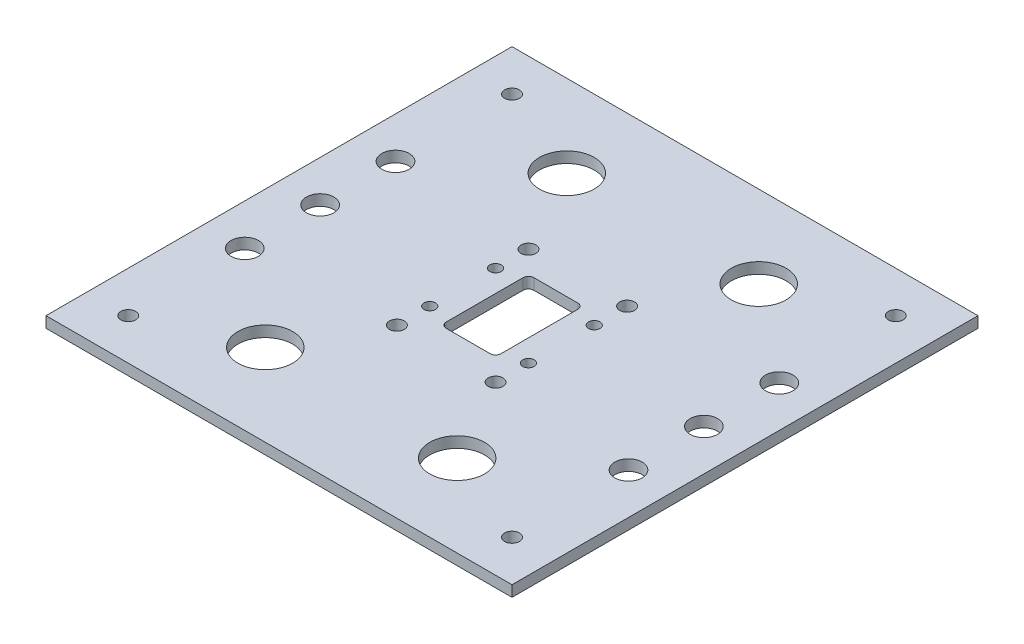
ISO-10303-21;
HEADER;
FILE_DESCRIPTION(('STEP AP214'),'2;1');
FILE_NAME('part.step','',(''),(''),'','','');
FILE_SCHEMA(('AUTOMOTIVE_DESIGN { 1 0 10303 214 1 1 1 1 }'));
ENDSEC;
DATA;
#1=APPLICATION_CONTEXT('core data for automotive mechanical design processes');
#2=APPLICATION_PROTOCOL_DEFINITION('international standard','automotive_design',2000,#1);
#3=PRODUCT_CONTEXT('',#1,'mechanical');
#4=PRODUCT('Part','Part','',(#3));
#5=PRODUCT_RELATED_PRODUCT_CATEGORY('part','',(#4));
#6=PRODUCT_DEFINITION_FORMATION('','',#4);
#7=PRODUCT_DEFINITION_CONTEXT('part definition',#1,'design');
#8=PRODUCT_DEFINITION('design','',#6,#7);
#9=PRODUCT_DEFINITION_SHAPE('','',#8);
#10=(LENGTH_UNIT() NAMED_UNIT(*) SI_UNIT(.MILLI.,.METRE.));
#11=(NAMED_UNIT(*) PLANE_ANGLE_UNIT() SI_UNIT($,.RADIAN.));
#12=(NAMED_UNIT(*) SI_UNIT($,.STERADIAN.) SOLID_ANGLE_UNIT());
#13=UNCERTAINTY_MEASURE_WITH_UNIT(LENGTH_MEASURE(1.E-05),#10,'distance_accuracy_value','');
#14=(GEOMETRIC_REPRESENTATION_CONTEXT(3) GLOBAL_UNCERTAINTY_ASSIGNED_CONTEXT((#13)) GLOBAL_UNIT_ASSIGNED_CONTEXT((#10,
#11,#12)) REPRESENTATION_CONTEXT('',''));
#15=CARTESIAN_POINT('',(0.,0.,0.));
#16=DIRECTION('',(0.,0.,1.));
#17=DIRECTION('',(1.,0.,0.));
#18=AXIS2_PLACEMENT_3D('',#15,#16,#17);
#19=CARTESIAN_POINT('',(-8.,-6.,14.));
#20=DIRECTION('',(0.,-1.,0.));
#21=DIRECTION('',(0.,0.,-1.));
#22=AXIS2_PLACEMENT_3D('',#19,#20,#21);
#23=CYLINDRICAL_SURFACE('',#22,2.);
#24=CARTESIAN_POINT('',(-8.,0.,14.));
#25=DIRECTION('',(0.,1.,0.));
#26=DIRECTION('',(0.,0.,-1.));
#27=AXIS2_PLACEMENT_3D('',#24,#25,#26);
#28=CIRCLE('',#27,2.);
#29=CARTESIAN_POINT('',(-10.,0.,14.));
#30=VERTEX_POINT('',#29);
#31=CARTESIAN_POINT('',(-8.,0.,16.));
#32=VERTEX_POINT('',#31);
#33=EDGE_CURVE('E246',#30,#32,#28,.T.);
#34=ORIENTED_EDGE('',*,*,#33,.F.);
#35=DIRECTION('',(0.,-1.,0.));
#36=VECTOR('',#35,1.);
#37=CARTESIAN_POINT('',(-10.,0.,14.));
#38=LINE('',#37,#36);
#39=CARTESIAN_POINT('',(-10.,4.,14.));
#40=VERTEX_POINT('',#39);
#41=EDGE_CURVE('E412',#40,#30,#38,.T.);
#42=ORIENTED_EDGE('',*,*,#41,.F.);
#43=CARTESIAN_POINT('',(-8.,4.,14.));
#44=DIRECTION('',(0.,-1.,0.));
#45=DIRECTION('',(0.,0.,-1.));
#46=AXIS2_PLACEMENT_3D('',#43,#44,#45);
#47=CIRCLE('',#46,2.);
#48=CARTESIAN_POINT('',(-8.,4.,16.));
#49=VERTEX_POINT('',#48);
#50=EDGE_CURVE('E221',#49,#40,#47,.T.);
#51=ORIENTED_EDGE('',*,*,#50,.F.);
#52=DIRECTION('',(0.,1.,0.));
#53=VECTOR('',#52,1.);
#54=CARTESIAN_POINT('',(-8.,4.,16.));
#55=LINE('',#54,#53);
#56=EDGE_CURVE('E49',#32,#49,#55,.T.);
#57=ORIENTED_EDGE('',*,*,#56,.F.);
#58=EDGE_LOOP('',(#34,#42,#51,#57));
#59=FACE_BOUND('',#58,.T.);
#60=ADVANCED_FACE('F17',(#59),#23,.F.);
#61=CARTESIAN_POINT('',(8.,-6.,14.));
#62=DIRECTION('',(0.,-1.,0.));
#63=DIRECTION('',(0.,0.,-1.));
#64=AXIS2_PLACEMENT_3D('',#61,#62,#63);
#65=CYLINDRICAL_SURFACE('',#64,2.);
#66=CARTESIAN_POINT('',(8.,0.,14.));
#67=DIRECTION('',(0.,1.,0.));
#68=DIRECTION('',(0.,0.,-1.));
#69=AXIS2_PLACEMENT_3D('',#66,#67,#68);
#70=CIRCLE('',#69,2.);
#71=CARTESIAN_POINT('',(8.,0.,16.));
#72=VERTEX_POINT('',#71);
#73=CARTESIAN_POINT('',(10.,0.,14.));
#74=VERTEX_POINT('',#73);
#75=EDGE_CURVE('E152',#72,#74,#70,.T.);
#76=ORIENTED_EDGE('',*,*,#75,.F.);
#77=DIRECTION('',(0.,-1.,0.));
#78=VECTOR('',#77,1.);
#79=CARTESIAN_POINT('',(8.,0.,16.));
#80=LINE('',#79,#78);
#81=CARTESIAN_POINT('',(8.,4.,16.));
#82=VERTEX_POINT('',#81);
#83=EDGE_CURVE('E38',#82,#72,#80,.T.);
#84=ORIENTED_EDGE('',*,*,#83,.F.);
#85=CARTESIAN_POINT('',(8.,4.,14.));
#86=DIRECTION('',(0.,-1.,0.));
#87=DIRECTION('',(0.,0.,-1.));
#88=AXIS2_PLACEMENT_3D('',#85,#86,#87);
#89=CIRCLE('',#88,2.);
#90=CARTESIAN_POINT('',(10.,4.,14.));
#91=VERTEX_POINT('',#90);
#92=EDGE_CURVE('E346',#91,#82,#89,.T.);
#93=ORIENTED_EDGE('',*,*,#92,.F.);
#94=DIRECTION('',(0.,1.,0.));
#95=VECTOR('',#94,1.);
#96=CARTESIAN_POINT('',(10.,4.,14.));
#97=LINE('',#96,#95);
#98=EDGE_CURVE('E197',#74,#91,#97,.T.);
#99=ORIENTED_EDGE('',*,*,#98,.F.);
#100=EDGE_LOOP('',(#76,#84,#93,#99));
#101=FACE_BOUND('',#100,.T.);
#102=ADVANCED_FACE('F444',(#101),#65,.F.);
#103=CARTESIAN_POINT('',(-8.,-6.,-14.));
#104=DIRECTION('',(0.,-1.,0.));
#105=DIRECTION('',(0.,0.,-1.));
#106=AXIS2_PLACEMENT_3D('',#103,#104,#105);
#107=CYLINDRICAL_SURFACE('',#106,2.);
#108=CARTESIAN_POINT('',(-8.,0.,-14.));
#109=DIRECTION('',(0.,1.,0.));
#110=DIRECTION('',(0.,0.,-1.));
#111=AXIS2_PLACEMENT_3D('',#108,#109,#110);
#112=CIRCLE('',#111,2.);
#113=CARTESIAN_POINT('',(-8.,0.,-16.));
#114=VERTEX_POINT('',#113);
#115=CARTESIAN_POINT('',(-10.,0.,-14.));
#116=VERTEX_POINT('',#115);
#117=EDGE_CURVE('E387',#114,#116,#112,.T.);
#118=ORIENTED_EDGE('',*,*,#117,.F.);
#119=DIRECTION('',(0.,-1.,0.));
#120=VECTOR('',#119,1.);
#121=CARTESIAN_POINT('',(-8.,0.,-16.));
#122=LINE('',#121,#120);
#123=CARTESIAN_POINT('',(-8.,4.,-16.));
#124=VERTEX_POINT('',#123);
#125=EDGE_CURVE('E11',#124,#114,#122,.T.);
#126=ORIENTED_EDGE('',*,*,#125,.F.);
#127=CARTESIAN_POINT('',(-8.,4.,-14.));
#128=DIRECTION('',(0.,-1.,0.));
#129=DIRECTION('',(0.,0.,-1.));
#130=AXIS2_PLACEMENT_3D('',#127,#128,#129);
#131=CIRCLE('',#130,2.);
#132=CARTESIAN_POINT('',(-10.,4.,-14.));
#133=VERTEX_POINT('',#132);
#134=EDGE_CURVE('E168',#133,#124,#131,.T.);
#135=ORIENTED_EDGE('',*,*,#134,.F.);
#136=DIRECTION('',(0.,1.,0.));
#137=VECTOR('',#136,1.);
#138=CARTESIAN_POINT('',(-10.,4.,-14.));
#139=LINE('',#138,#137);
#140=EDGE_CURVE('E369',#116,#133,#139,.T.);
#141=ORIENTED_EDGE('',*,*,#140,.F.);
#142=EDGE_LOOP('',(#118,#126,#135,#141));
#143=FACE_BOUND('',#142,.T.);
#144=ADVANCED_FACE('F433',(#143),#107,.F.);
#145=CARTESIAN_POINT('',(8.,-6.,-14.));
#146=DIRECTION('',(0.,-1.,0.));
#147=DIRECTION('',(0.,0.,-1.));
#148=AXIS2_PLACEMENT_3D('',#145,#146,#147);
#149=CYLINDRICAL_SURFACE('',#148,2.);
#150=CARTESIAN_POINT('',(8.,0.,-14.));
#151=DIRECTION('',(0.,1.,0.));
#152=DIRECTION('',(0.,0.,-1.));
#153=AXIS2_PLACEMENT_3D('',#150,#151,#152);
#154=CIRCLE('',#153,2.);
#155=CARTESIAN_POINT('',(10.,0.,-14.));
#156=VERTEX_POINT('',#155);
#157=CARTESIAN_POINT('',(8.,0.,-16.));
#158=VERTEX_POINT('',#157);
#159=EDGE_CURVE('E379',#156,#158,#154,.T.);
#160=ORIENTED_EDGE('',*,*,#159,.F.);
#161=DIRECTION('',(0.,-1.,0.));
#162=VECTOR('',#161,1.);
#163=CARTESIAN_POINT('',(10.,0.,-14.));
#164=LINE('',#163,#162);
#165=CARTESIAN_POINT('',(10.,4.,-14.));
#166=VERTEX_POINT('',#165);
#167=EDGE_CURVE('E194',#166,#156,#164,.T.);
#168=ORIENTED_EDGE('',*,*,#167,.F.);
#169=CARTESIAN_POINT('',(8.,4.,-14.));
#170=DIRECTION('',(0.,-1.,0.));
#171=DIRECTION('',(0.,0.,-1.));
#172=AXIS2_PLACEMENT_3D('',#169,#170,#171);
#173=CIRCLE('',#172,2.);
#174=CARTESIAN_POINT('',(8.,4.,-16.));
#175=VERTEX_POINT('',#174);
#176=EDGE_CURVE('E211',#175,#166,#173,.T.);
#177=ORIENTED_EDGE('',*,*,#176,.F.);
#178=DIRECTION('',(0.,1.,0.));
#179=VECTOR('',#178,1.);
#180=CARTESIAN_POINT('',(8.,4.,-16.));
#181=LINE('',#180,#179);
#182=EDGE_CURVE('E25',#158,#175,#181,.T.);
#183=ORIENTED_EDGE('',*,*,#182,.F.);
#184=EDGE_LOOP('',(#160,#168,#177,#183));
#185=FACE_BOUND('',#184,.T.);
#186=ADVANCED_FACE('F424',(#185),#149,.F.);
#187=CARTESIAN_POINT('',(-10.,-6.,-16.));
#188=DIRECTION('',(0.,0.,-1.));
#189=DIRECTION('',(0.,-1.,0.));
#190=AXIS2_PLACEMENT_3D('',#187,#188,#189);
#191=PLANE('',#190);
#192=DIRECTION('',(1.,0.,0.));
#193=VECTOR('',#192,1.);
#194=CARTESIAN_POINT('',(0.,0.,-16.));
#195=LINE('',#194,#193);
#196=EDGE_CURVE('E383',#114,#158,#195,.T.);
#197=ORIENTED_EDGE('',*,*,#196,.T.);
#198=ORIENTED_EDGE('',*,*,#182,.T.);
#199=DIRECTION('',(-1.,0.,0.));
#200=VECTOR('',#199,1.);
#201=CARTESIAN_POINT('',(-10.,4.,-16.));
#202=LINE('',#201,#200);
#203=EDGE_CURVE('E207',#175,#124,#202,.T.);
#204=ORIENTED_EDGE('',*,*,#203,.T.);
#205=ORIENTED_EDGE('',*,*,#125,.T.);
#206=EDGE_LOOP('',(#197,#198,#204,#205));
#207=FACE_BOUND('',#206,.T.);
#208=ADVANCED_FACE('F419',(#207),#191,.F.);
#209=CARTESIAN_POINT('',(-10.,-6.,16.));
#210=DIRECTION('',(-1.,0.,0.));
#211=DIRECTION('',(0.,0.,1.));
#212=AXIS2_PLACEMENT_3D('',#209,#210,#211);
#213=PLANE('',#212);
#214=DIRECTION('',(0.,0.,-1.));
#215=VECTOR('',#214,1.);
#216=CARTESIAN_POINT('',(-10.,0.,0.));
#217=LINE('',#216,#215);
#218=EDGE_CURVE('E251',#30,#116,#217,.T.);
#219=ORIENTED_EDGE('',*,*,#218,.T.);
#220=ORIENTED_EDGE('',*,*,#140,.T.);
#221=DIRECTION('',(0.,0.,1.));
#222=VECTOR('',#221,1.);
#223=CARTESIAN_POINT('',(-10.,4.,16.));
#224=LINE('',#223,#222);
#225=EDGE_CURVE('E177',#133,#40,#224,.T.);
#226=ORIENTED_EDGE('',*,*,#225,.T.);
#227=ORIENTED_EDGE('',*,*,#41,.T.);
#228=EDGE_LOOP('',(#219,#220,#226,#227));
#229=FACE_BOUND('',#228,.T.);
#230=ADVANCED_FACE('F447',(#229),#213,.F.);
#231=CARTESIAN_POINT('',(-10.,-6.,16.));
#232=DIRECTION('',(0.,0.,1.));
#233=DIRECTION('',(1.,0.,0.));
#234=AXIS2_PLACEMENT_3D('',#231,#232,#233);
#235=PLANE('',#234);
#236=DIRECTION('',(1.,0.,0.));
#237=VECTOR('',#236,1.);
#238=CARTESIAN_POINT('',(-10.,4.,16.));
#239=LINE('',#238,#237);
#240=EDGE_CURVE('E225',#49,#82,#239,.T.);
#241=ORIENTED_EDGE('',*,*,#240,.T.);
#242=ORIENTED_EDGE('',*,*,#83,.T.);
#243=DIRECTION('',(-1.,0.,0.));
#244=VECTOR('',#243,1.);
#245=CARTESIAN_POINT('',(0.,0.,16.));
#246=LINE('',#245,#244);
#247=EDGE_CURVE('E250',#72,#32,#246,.T.);
#248=ORIENTED_EDGE('',*,*,#247,.T.);
#249=ORIENTED_EDGE('',*,*,#56,.T.);
#250=EDGE_LOOP('',(#241,#242,#248,#249));
#251=FACE_BOUND('',#250,.T.);
#252=ADVANCED_FACE('F445',(#251),#235,.F.);
#253=CARTESIAN_POINT('',(10.,-6.,16.));
#254=DIRECTION('',(1.,0.,0.));
#255=DIRECTION('',(0.,1.,0.));
#256=AXIS2_PLACEMENT_3D('',#253,#254,#255);
#257=PLANE('',#256);
#258=DIRECTION('',(0.,0.,-1.));
#259=VECTOR('',#258,1.);
#260=CARTESIAN_POINT('',(10.,4.,16.));
#261=LINE('',#260,#259);
#262=EDGE_CURVE('E342',#91,#166,#261,.T.);
#263=ORIENTED_EDGE('',*,*,#262,.T.);
#264=ORIENTED_EDGE('',*,*,#167,.T.);
#265=DIRECTION('',(0.,0.,1.));
#266=VECTOR('',#265,1.);
#267=CARTESIAN_POINT('',(10.,0.,0.));
#268=LINE('',#267,#266);
#269=EDGE_CURVE('E162',#156,#74,#268,.T.);
#270=ORIENTED_EDGE('',*,*,#269,.T.);
#271=ORIENTED_EDGE('',*,*,#98,.T.);
#272=EDGE_LOOP('',(#263,#264,#270,#271));
#273=FACE_BOUND('',#272,.T.);
#274=ADVANCED_FACE('F440',(#273),#257,.F.);
#275=CARTESIAN_POINT('',(-85.,4.,85.));
#276=DIRECTION('',(0.,0.,-1.));
#277=DIRECTION('',(0.,-1.,0.));
#278=AXIS2_PLACEMENT_3D('',#275,#276,#277);
#279=PLANE('',#278);
#280=DIRECTION('',(1.,0.,0.));
#281=VECTOR('',#280,1.);
#282=CARTESIAN_POINT('',(-85.,0.,85.));
#283=LINE('',#282,#281);
#284=CARTESIAN_POINT('',(-85.,0.,85.));
#285=VERTEX_POINT('',#284);
#286=CARTESIAN_POINT('',(85.,0.,85.));
#287=VERTEX_POINT('',#286);
#288=EDGE_CURVE('E167',#285,#287,#283,.T.);
#289=ORIENTED_EDGE('',*,*,#288,.T.);
#290=DIRECTION('',(0.,-1.,0.));
#291=VECTOR('',#290,1.);
#292=CARTESIAN_POINT('',(85.,4.,85.));
#293=LINE('',#292,#291);
#294=CARTESIAN_POINT('',(85.,4.,85.));
#295=VERTEX_POINT('',#294);
#296=EDGE_CURVE('E151',#295,#287,#293,.T.);
#297=ORIENTED_EDGE('',*,*,#296,.F.);
#298=DIRECTION('',(1.,0.,0.));
#299=VECTOR('',#298,1.);
#300=CARTESIAN_POINT('',(-85.,4.,85.));
#301=LINE('',#300,#299);
#302=CARTESIAN_POINT('',(-85.,4.,85.));
#303=VERTEX_POINT('',#302);
#304=EDGE_CURVE('E212',#303,#295,#301,.T.);
#305=ORIENTED_EDGE('',*,*,#304,.F.);
#306=DIRECTION('',(0.,-1.,0.));
#307=VECTOR('',#306,1.);
#308=CARTESIAN_POINT('',(-85.,4.,85.));
#309=LINE('',#308,#307);
#310=EDGE_CURVE('E198',#303,#285,#309,.T.);
#311=ORIENTED_EDGE('',*,*,#310,.T.);
#312=EDGE_LOOP('',(#289,#297,#305,#311));
#313=FACE_BOUND('',#312,.T.);
#314=ADVANCED_FACE('F499',(#313),#279,.F.);
#315=CARTESIAN_POINT('',(-85.,4.,85.));
#316=DIRECTION('',(1.,0.,0.));
#317=DIRECTION('',(0.,1.,0.));
#318=AXIS2_PLACEMENT_3D('',#315,#316,#317);
#319=PLANE('',#318);
#320=DIRECTION('',(0.,0.,1.));
#321=VECTOR('',#320,1.);
#322=CARTESIAN_POINT('',(-85.,0.,85.));
#323=LINE('',#322,#321);
#324=CARTESIAN_POINT('',(-85.,0.,-85.));
#325=VERTEX_POINT('',#324);
#326=EDGE_CURVE('E160',#325,#285,#323,.T.);
#327=ORIENTED_EDGE('',*,*,#326,.T.);
#328=ORIENTED_EDGE('',*,*,#310,.F.);
#329=DIRECTION('',(0.,0.,1.));
#330=VECTOR('',#329,1.);
#331=CARTESIAN_POINT('',(-85.,4.,85.));
#332=LINE('',#331,#330);
#333=CARTESIAN_POINT('',(-85.,4.,-85.));
#334=VERTEX_POINT('',#333);
#335=EDGE_CURVE('E268',#334,#303,#332,.T.);
#336=ORIENTED_EDGE('',*,*,#335,.F.);
#337=DIRECTION('',(0.,-1.,0.));
#338=VECTOR('',#337,1.);
#339=CARTESIAN_POINT('',(-85.,4.,-85.));
#340=LINE('',#339,#338);
#341=EDGE_CURVE('E401',#334,#325,#340,.T.);
#342=ORIENTED_EDGE('',*,*,#341,.T.);
#343=EDGE_LOOP('',(#327,#328,#336,#342));
#344=FACE_BOUND('',#343,.T.);
#345=ADVANCED_FACE('F510',(#344),#319,.F.);
#346=CARTESIAN_POINT('',(-85.,4.,-85.));
#347=DIRECTION('',(0.,0.,1.));
#348=DIRECTION('',(1.,0.,0.));
#349=AXIS2_PLACEMENT_3D('',#346,#347,#348);
#350=PLANE('',#349);
#351=DIRECTION('',(-1.,0.,0.));
#352=VECTOR('',#351,1.);
#353=CARTESIAN_POINT('',(-85.,0.,-85.));
#354=LINE('',#353,#352);
#355=CARTESIAN_POINT('',(85.,0.,-85.));
#356=VERTEX_POINT('',#355);
#357=EDGE_CURVE('E142',#356,#325,#354,.T.);
#358=ORIENTED_EDGE('',*,*,#357,.T.);
#359=ORIENTED_EDGE('',*,*,#341,.F.);
#360=DIRECTION('',(-1.,0.,0.));
#361=VECTOR('',#360,1.);
#362=CARTESIAN_POINT('',(-85.,4.,-85.));
#363=LINE('',#362,#361);
#364=CARTESIAN_POINT('',(85.,4.,-85.));
#365=VERTEX_POINT('',#364);
#366=EDGE_CURVE('E145',#365,#334,#363,.T.);
#367=ORIENTED_EDGE('',*,*,#366,.F.);
#368=DIRECTION('',(0.,-1.,0.));
#369=VECTOR('',#368,1.);
#370=CARTESIAN_POINT('',(85.,4.,-85.));
#371=LINE('',#370,#369);
#372=EDGE_CURVE('E139',#365,#356,#371,.T.);
#373=ORIENTED_EDGE('',*,*,#372,.T.);
#374=EDGE_LOOP('',(#358,#359,#367,#373));
#375=FACE_BOUND('',#374,.T.);
#376=ADVANCED_FACE('F141',(#375),#350,.F.);
#377=CARTESIAN_POINT('',(85.,4.,85.));
#378=DIRECTION('',(-1.,0.,0.));
#379=DIRECTION('',(0.,0.,1.));
#380=AXIS2_PLACEMENT_3D('',#377,#378,#379);
#381=PLANE('',#380);
#382=DIRECTION('',(0.,0.,-1.));
#383=VECTOR('',#382,1.);
#384=CARTESIAN_POINT('',(85.,0.,85.));
#385=LINE('',#384,#383);
#386=EDGE_CURVE('E158',#287,#356,#385,.T.);
#387=ORIENTED_EDGE('',*,*,#386,.T.);
#388=ORIENTED_EDGE('',*,*,#372,.F.);
#389=DIRECTION('',(0.,0.,-1.));
#390=VECTOR('',#389,1.);
#391=CARTESIAN_POINT('',(85.,4.,85.));
#392=LINE('',#391,#390);
#393=EDGE_CURVE('E238',#295,#365,#392,.T.);
#394=ORIENTED_EDGE('',*,*,#393,.F.);
#395=ORIENTED_EDGE('',*,*,#296,.T.);
#396=EDGE_LOOP('',(#387,#388,#394,#395));
#397=FACE_BOUND('',#396,.T.);
#398=ADVANCED_FACE('F164',(#397),#381,.F.);
#399=CARTESIAN_POINT('',(0.,0.,0.));
#400=DIRECTION('',(0.,-1.,0.));
#401=DIRECTION('',(0.,0.,-1.));
#402=AXIS2_PLACEMENT_3D('',#399,#400,#401);
#403=PLANE('',#402);
#404=CARTESIAN_POINT('',(-70.,0.,70.));
#405=DIRECTION('',(0.,1.,0.));
#406=DIRECTION('',(0.,0.,1.));
#407=AXIS2_PLACEMENT_3D('',#404,#405,#406);
#408=CIRCLE('',#407,2.7);
#409=CARTESIAN_POINT('',(-70.,0.,72.7));
#410=VERTEX_POINT('',#409);
#411=EDGE_CURVE('E333',#410,#410,#408,.T.);
#412=ORIENTED_EDGE('',*,*,#411,.T.);
#413=EDGE_LOOP('',(#412));
#414=FACE_BOUND('',#413,.T.);
#415=CARTESIAN_POINT('',(70.,0.,-70.));
#416=DIRECTION('',(0.,1.,0.));
#417=DIRECTION('',(0.,0.,1.));
#418=AXIS2_PLACEMENT_3D('',#415,#416,#417);
#419=CIRCLE('',#418,2.7);
#420=CARTESIAN_POINT('',(70.,0.,-67.3));
#421=VERTEX_POINT('',#420);
#422=EDGE_CURVE('E354',#421,#421,#419,.T.);
#423=ORIENTED_EDGE('',*,*,#422,.T.);
#424=EDGE_LOOP('',(#423));
#425=FACE_BOUND('',#424,.T.);
#426=CARTESIAN_POINT('',(-70.,0.,-70.));
#427=DIRECTION('',(0.,1.,0.));
#428=DIRECTION('',(0.,0.,1.));
#429=AXIS2_PLACEMENT_3D('',#426,#427,#428);
#430=CIRCLE('',#429,2.7);
#431=CARTESIAN_POINT('',(-70.,0.,-67.3));
#432=VERTEX_POINT('',#431);
#433=EDGE_CURVE('E241',#432,#432,#430,.T.);
#434=ORIENTED_EDGE('',*,*,#433,.T.);
#435=EDGE_LOOP('',(#434));
#436=FACE_BOUND('',#435,.T.);
#437=CARTESIAN_POINT('',(70.,0.,70.));
#438=DIRECTION('',(0.,1.,0.));
#439=DIRECTION('',(0.,0.,1.));
#440=AXIS2_PLACEMENT_3D('',#437,#438,#439);
#441=CIRCLE('',#440,2.7);
#442=CARTESIAN_POINT('',(70.,0.,72.7));
#443=VERTEX_POINT('',#442);
#444=EDGE_CURVE('E338',#443,#443,#441,.T.);
#445=ORIENTED_EDGE('',*,*,#444,.T.);
#446=EDGE_LOOP('',(#445));
#447=FACE_BOUND('',#446,.T.);
#448=CARTESIAN_POINT('',(-18.,0.,-24.));
#449=DIRECTION('',(0.,-1.,0.));
#450=DIRECTION('',(0.,0.,-1.));
#451=AXIS2_PLACEMENT_3D('',#448,#449,#450);
#452=CIRCLE('',#451,2.7);
#453=CARTESIAN_POINT('',(-18.,0.,-26.7));
#454=VERTEX_POINT('',#453);
#455=EDGE_CURVE('E321',#454,#454,#452,.T.);
#456=ORIENTED_EDGE('',*,*,#455,.F.);
#457=EDGE_LOOP('',(#456));
#458=FACE_BOUND('',#457,.T.);
#459=CARTESIAN_POINT('',(18.,0.,12.));
#460=DIRECTION('',(0.,-1.,0.));
#461=DIRECTION('',(0.,0.,-1.));
#462=AXIS2_PLACEMENT_3D('',#459,#460,#461);
#463=CIRCLE('',#462,2.1);
#464=CARTESIAN_POINT('',(18.,0.,9.9));
#465=VERTEX_POINT('',#464);
#466=EDGE_CURVE('E300',#465,#465,#463,.T.);
#467=ORIENTED_EDGE('',*,*,#466,.F.);
#468=EDGE_LOOP('',(#467));
#469=FACE_BOUND('',#468,.T.);
#470=CARTESIAN_POINT('',(18.,0.,24.));
#471=DIRECTION('',(0.,-1.,0.));
#472=DIRECTION('',(0.,0.,-1.));
#473=AXIS2_PLACEMENT_3D('',#470,#471,#472);
#474=CIRCLE('',#473,2.7);
#475=CARTESIAN_POINT('',(18.,0.,21.3));
#476=VERTEX_POINT('',#475);
#477=EDGE_CURVE('E314',#476,#476,#474,.T.);
#478=ORIENTED_EDGE('',*,*,#477,.F.);
#479=EDGE_LOOP('',(#478));
#480=FACE_BOUND('',#479,.T.);
#481=CARTESIAN_POINT('',(-18.,0.,24.));
#482=DIRECTION('',(0.,-1.,0.));
#483=DIRECTION('',(0.,0.,-1.));
#484=AXIS2_PLACEMENT_3D('',#481,#482,#483);
#485=CIRCLE('',#484,2.7);
#486=CARTESIAN_POINT('',(-18.,0.,21.3));
#487=VERTEX_POINT('',#486);
#488=EDGE_CURVE('E309',#487,#487,#485,.T.);
#489=ORIENTED_EDGE('',*,*,#488,.F.);
#490=EDGE_LOOP('',(#489));
#491=FACE_BOUND('',#490,.T.);
#492=CARTESIAN_POINT('',(-18.,0.,12.));
#493=DIRECTION('',(0.,-1.,0.));
#494=DIRECTION('',(0.,0.,-1.));
#495=AXIS2_PLACEMENT_3D('',#492,#493,#494);
#496=CIRCLE('',#495,2.1);
#497=CARTESIAN_POINT('',(-18.,0.,9.9));
#498=VERTEX_POINT('',#497);
#499=EDGE_CURVE('E293',#498,#498,#496,.T.);
#500=ORIENTED_EDGE('',*,*,#499,.F.);
#501=EDGE_LOOP('',(#500));
#502=FACE_BOUND('',#501,.T.);
#503=CARTESIAN_POINT('',(-18.,0.,-12.));
#504=DIRECTION('',(0.,-1.,0.));
#505=DIRECTION('',(0.,0.,-1.));
#506=AXIS2_PLACEMENT_3D('',#503,#504,#505);
#507=CIRCLE('',#506,2.1);
#508=CARTESIAN_POINT('',(-18.,0.,-14.1));
#509=VERTEX_POINT('',#508);
#510=EDGE_CURVE('E285',#509,#509,#507,.T.);
#511=ORIENTED_EDGE('',*,*,#510,.F.);
#512=EDGE_LOOP('',(#511));
#513=FACE_BOUND('',#512,.T.);
#514=CARTESIAN_POINT('',(18.,0.,-12.));
#515=DIRECTION('',(0.,-1.,0.));
#516=DIRECTION('',(0.,0.,-1.));
#517=AXIS2_PLACEMENT_3D('',#514,#515,#516);
#518=CIRCLE('',#517,2.1);
#519=CARTESIAN_POINT('',(18.,0.,-14.1));
#520=VERTEX_POINT('',#519);
#521=EDGE_CURVE('E280',#520,#520,#518,.T.);
#522=ORIENTED_EDGE('',*,*,#521,.F.);
#523=EDGE_LOOP('',(#522));
#524=FACE_BOUND('',#523,.T.);
#525=CARTESIAN_POINT('',(18.,0.,-24.));
#526=DIRECTION('',(0.,-1.,0.));
#527=DIRECTION('',(0.,0.,-1.));
#528=AXIS2_PLACEMENT_3D('',#525,#526,#527);
#529=CIRCLE('',#528,2.7);
#530=CARTESIAN_POINT('',(18.,0.,-26.7));
#531=VERTEX_POINT('',#530);
#532=EDGE_CURVE('E272',#531,#531,#529,.T.);
#533=ORIENTED_EDGE('',*,*,#532,.F.);
#534=EDGE_LOOP('',(#533));
#535=FACE_BOUND('',#534,.T.);
#536=ORIENTED_EDGE('',*,*,#269,.F.);
#537=ORIENTED_EDGE('',*,*,#159,.T.);
#538=ORIENTED_EDGE('',*,*,#196,.F.);
#539=ORIENTED_EDGE('',*,*,#117,.T.);
#540=ORIENTED_EDGE('',*,*,#218,.F.);
#541=ORIENTED_EDGE('',*,*,#33,.T.);
#542=ORIENTED_EDGE('',*,*,#247,.F.);
#543=ORIENTED_EDGE('',*,*,#75,.T.);
#544=EDGE_LOOP('',(#536,#537,#538,#539,#540,#541,#542,#543));
#545=FACE_BOUND('',#544,.T.);
#546=CARTESIAN_POINT('',(-70.,0.,-27.5));
#547=DIRECTION('',(0.,-1.,0.));
#548=DIRECTION('',(0.,0.,-1.));
#549=AXIS2_PLACEMENT_3D('',#546,#547,#548);
#550=CIRCLE('',#549,5.);
#551=CARTESIAN_POINT('',(-70.,0.,-32.5));
#552=VERTEX_POINT('',#551);
#553=EDGE_CURVE('E267',#552,#552,#550,.T.);
#554=ORIENTED_EDGE('',*,*,#553,.F.);
#555=EDGE_LOOP('',(#554));
#556=FACE_BOUND('',#555,.T.);
#557=CARTESIAN_POINT('',(70.,0.,27.4999999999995));
#558=DIRECTION('',(0.,-1.,0.));
#559=DIRECTION('',(0.,0.,-1.));
#560=AXIS2_PLACEMENT_3D('',#557,#558,#559);
#561=CIRCLE('',#560,5.);
#562=CARTESIAN_POINT('',(70.,0.,22.4999999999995));
#563=VERTEX_POINT('',#562);
#564=EDGE_CURVE('E259',#563,#563,#561,.T.);
#565=ORIENTED_EDGE('',*,*,#564,.F.);
#566=EDGE_LOOP('',(#565));
#567=FACE_BOUND('',#566,.T.);
#568=CARTESIAN_POINT('',(70.,0.,-5.13478148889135E-13));
#569=DIRECTION('',(0.,-1.,0.));
#570=DIRECTION('',(0.,0.,-1.));
#571=AXIS2_PLACEMENT_3D('',#568,#569,#570);
#572=CIRCLE('',#571,5.);
#573=CARTESIAN_POINT('',(70.,0.,-5.00000000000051));
#574=VERTEX_POINT('',#573);
#575=EDGE_CURVE('E245',#574,#574,#572,.T.);
#576=ORIENTED_EDGE('',*,*,#575,.F.);
#577=EDGE_LOOP('',(#576));
#578=FACE_BOUND('',#577,.T.);
#579=CARTESIAN_POINT('',(70.,0.,-27.5000000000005));
#580=DIRECTION('',(0.,-1.,0.));
#581=DIRECTION('',(0.,0.,-1.));
#582=AXIS2_PLACEMENT_3D('',#579,#580,#581);
#583=CIRCLE('',#582,5.);
#584=CARTESIAN_POINT('',(70.,0.,-32.5000000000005));
#585=VERTEX_POINT('',#584);
#586=EDGE_CURVE('E232',#585,#585,#583,.T.);
#587=ORIENTED_EDGE('',*,*,#586,.F.);
#588=EDGE_LOOP('',(#587));
#589=FACE_BOUND('',#588,.T.);
#590=CARTESIAN_POINT('',(-70.,0.,27.5));
#591=DIRECTION('',(0.,-1.,0.));
#592=DIRECTION('',(0.,0.,-1.));
#593=AXIS2_PLACEMENT_3D('',#590,#591,#592);
#594=CIRCLE('',#593,5.);
#595=CARTESIAN_POINT('',(-70.,0.,22.5));
#596=VERTEX_POINT('',#595);
#597=EDGE_CURVE('E220',#596,#596,#594,.T.);
#598=ORIENTED_EDGE('',*,*,#597,.F.);
#599=EDGE_LOOP('',(#598));
#600=FACE_BOUND('',#599,.T.);
#601=CARTESIAN_POINT('',(-70.,0.,-1.80411241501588E-13));
#602=DIRECTION('',(0.,-1.,0.));
#603=DIRECTION('',(0.,0.,-1.));
#604=AXIS2_PLACEMENT_3D('',#601,#602,#603);
#605=CIRCLE('',#604,5.);
#606=CARTESIAN_POINT('',(-70.,0.,-5.00000000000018));
#607=VERTEX_POINT('',#606);
#608=EDGE_CURVE('E206',#607,#607,#605,.T.);
#609=ORIENTED_EDGE('',*,*,#608,.F.);
#610=EDGE_LOOP('',(#609));
#611=FACE_BOUND('',#610,.T.);
#612=CARTESIAN_POINT('',(-35.,0.,-55.));
#613=DIRECTION('',(0.,1.,0.));
#614=DIRECTION('',(0.,0.,1.));
#615=AXIS2_PLACEMENT_3D('',#612,#613,#614);
#616=CIRCLE('',#615,10.);
#617=CARTESIAN_POINT('',(-35.,0.,-45.));
#618=VERTEX_POINT('',#617);
#619=EDGE_CURVE('E183',#618,#618,#616,.T.);
#620=ORIENTED_EDGE('',*,*,#619,.T.);
#621=EDGE_LOOP('',(#620));
#622=FACE_BOUND('',#621,.T.);
#623=CARTESIAN_POINT('',(35.,0.,-55.));
#624=DIRECTION('',(0.,1.,0.));
#625=DIRECTION('',(0.,0.,1.));
#626=AXIS2_PLACEMENT_3D('',#623,#624,#625);
#627=CIRCLE('',#626,10.);
#628=CARTESIAN_POINT('',(35.,0.,-45.));
#629=VERTEX_POINT('',#628);
#630=EDGE_CURVE('E181',#629,#629,#627,.T.);
#631=ORIENTED_EDGE('',*,*,#630,.T.);
#632=EDGE_LOOP('',(#631));
#633=FACE_BOUND('',#632,.T.);
#634=CARTESIAN_POINT('',(35.,0.,55.));
#635=DIRECTION('',(0.,1.,0.));
#636=DIRECTION('',(0.,0.,-1.));
#637=AXIS2_PLACEMENT_3D('',#634,#635,#636);
#638=CIRCLE('',#637,10.);
#639=CARTESIAN_POINT('',(35.,0.,45.));
#640=VERTEX_POINT('',#639);
#641=EDGE_CURVE('E917',#640,#640,#638,.T.);
#642=ORIENTED_EDGE('',*,*,#641,.T.);
#643=EDGE_LOOP('',(#642));
#644=FACE_BOUND('',#643,.T.);
#645=CARTESIAN_POINT('',(-35.,0.,55.));
#646=DIRECTION('',(0.,1.,0.));
#647=DIRECTION('',(0.,0.,-1.));
#648=AXIS2_PLACEMENT_3D('',#645,#646,#647);
#649=CIRCLE('',#648,10.);
#650=CARTESIAN_POINT('',(-35.,0.,45.));
#651=VERTEX_POINT('',#650);
#652=EDGE_CURVE('E932',#651,#651,#649,.T.);
#653=ORIENTED_EDGE('',*,*,#652,.T.);
#654=EDGE_LOOP('',(#653));
#655=FACE_BOUND('',#654,.T.);
#656=ORIENTED_EDGE('',*,*,#386,.F.);
#657=ORIENTED_EDGE('',*,*,#288,.F.);
#658=ORIENTED_EDGE('',*,*,#326,.F.);
#659=ORIENTED_EDGE('',*,*,#357,.F.);
#660=EDGE_LOOP('',(#656,#657,#658,#659));
#661=FACE_BOUND('',#660,.T.);
#662=ADVANCED_FACE('F156',(#414,#425,#436,#447,#458,#469,#480,#491,#502,#513,#524,#535,#545,
#556,#567,#578,#589,#600,#611,#622,#633,#644,#655,#661),#403,.T.);
#663=CARTESIAN_POINT('',(0.,4.,0.));
#664=DIRECTION('',(0.,-1.,0.));
#665=DIRECTION('',(0.,0.,-1.));
#666=AXIS2_PLACEMENT_3D('',#663,#664,#665);
#667=PLANE('',#666);
#668=CARTESIAN_POINT('',(-70.,4.,70.));
#669=DIRECTION('',(0.,1.,0.));
#670=DIRECTION('',(0.,0.,1.));
#671=AXIS2_PLACEMENT_3D('',#668,#669,#670);
#672=CIRCLE('',#671,2.7);
#673=CARTESIAN_POINT('',(-70.,4.,72.7));
#674=VERTEX_POINT('',#673);
#675=EDGE_CURVE('E329',#674,#674,#672,.T.);
#676=ORIENTED_EDGE('',*,*,#675,.F.);
#677=EDGE_LOOP('',(#676));
#678=FACE_BOUND('',#677,.T.);
#679=CARTESIAN_POINT('',(70.,4.,70.));
#680=DIRECTION('',(0.,1.,0.));
#681=DIRECTION('',(0.,0.,1.));
#682=AXIS2_PLACEMENT_3D('',#679,#680,#681);
#683=CIRCLE('',#682,2.7);
#684=CARTESIAN_POINT('',(70.,4.,72.7));
#685=VERTEX_POINT('',#684);
#686=EDGE_CURVE('E334',#685,#685,#683,.T.);
#687=ORIENTED_EDGE('',*,*,#686,.F.);
#688=EDGE_LOOP('',(#687));
#689=FACE_BOUND('',#688,.T.);
#690=CARTESIAN_POINT('',(70.,4.,-70.));
#691=DIRECTION('',(0.,1.,0.));
#692=DIRECTION('',(0.,0.,1.));
#693=AXIS2_PLACEMENT_3D('',#690,#691,#692);
#694=CIRCLE('',#693,2.7);
#695=CARTESIAN_POINT('',(70.,4.,-67.3));
#696=VERTEX_POINT('',#695);
#697=EDGE_CURVE('E350',#696,#696,#694,.T.);
#698=ORIENTED_EDGE('',*,*,#697,.F.);
#699=EDGE_LOOP('',(#698));
#700=FACE_BOUND('',#699,.T.);
#701=CARTESIAN_POINT('',(-70.,4.,-70.));
#702=DIRECTION('',(0.,1.,0.));
#703=DIRECTION('',(0.,0.,1.));
#704=AXIS2_PLACEMENT_3D('',#701,#702,#703);
#705=CIRCLE('',#704,2.7);
#706=CARTESIAN_POINT('',(-70.,4.,-67.3));
#707=VERTEX_POINT('',#706);
#708=EDGE_CURVE('E355',#707,#707,#705,.T.);
#709=ORIENTED_EDGE('',*,*,#708,.F.);
#710=EDGE_LOOP('',(#709));
#711=FACE_BOUND('',#710,.T.);
#712=CARTESIAN_POINT('',(-18.,4.,-24.));
#713=DIRECTION('',(0.,1.,0.));
#714=DIRECTION('',(0.,0.,1.));
#715=AXIS2_PLACEMENT_3D('',#712,#713,#714);
#716=CIRCLE('',#715,2.7);
#717=CARTESIAN_POINT('',(-18.,4.,-21.3));
#718=VERTEX_POINT('',#717);
#719=EDGE_CURVE('E325',#718,#718,#716,.T.);
#720=ORIENTED_EDGE('',*,*,#719,.F.);
#721=EDGE_LOOP('',(#720));
#722=FACE_BOUND('',#721,.T.);
#723=CARTESIAN_POINT('',(18.,4.,12.));
#724=DIRECTION('',(0.,1.,0.));
#725=DIRECTION('',(0.,0.,1.));
#726=AXIS2_PLACEMENT_3D('',#723,#724,#725);
#727=CIRCLE('',#726,2.1);
#728=CARTESIAN_POINT('',(18.,4.,14.1));
#729=VERTEX_POINT('',#728);
#730=EDGE_CURVE('E304',#729,#729,#727,.T.);
#731=ORIENTED_EDGE('',*,*,#730,.F.);
#732=EDGE_LOOP('',(#731));
#733=FACE_BOUND('',#732,.T.);
#734=CARTESIAN_POINT('',(18.,4.,24.));
#735=DIRECTION('',(0.,1.,0.));
#736=DIRECTION('',(0.,0.,1.));
#737=AXIS2_PLACEMENT_3D('',#734,#735,#736);
#738=CIRCLE('',#737,2.7);
#739=CARTESIAN_POINT('',(18.,4.,26.7));
#740=VERTEX_POINT('',#739);
#741=EDGE_CURVE('E305',#740,#740,#738,.T.);
#742=ORIENTED_EDGE('',*,*,#741,.F.);
#743=EDGE_LOOP('',(#742));
#744=FACE_BOUND('',#743,.T.);
#745=CARTESIAN_POINT('',(-18.,4.,24.));
#746=DIRECTION('',(0.,1.,0.));
#747=DIRECTION('',(0.,0.,1.));
#748=AXIS2_PLACEMENT_3D('',#745,#746,#747);
#749=CIRCLE('',#748,2.7);
#750=CARTESIAN_POINT('',(-18.,4.,26.7));
#751=VERTEX_POINT('',#750);
#752=EDGE_CURVE('E313',#751,#751,#749,.T.);
#753=ORIENTED_EDGE('',*,*,#752,.F.);
#754=EDGE_LOOP('',(#753));
#755=FACE_BOUND('',#754,.T.);
#756=CARTESIAN_POINT('',(-18.,4.,12.));
#757=DIRECTION('',(0.,1.,0.));
#758=DIRECTION('',(0.,0.,1.));
#759=AXIS2_PLACEMENT_3D('',#756,#757,#758);
#760=CIRCLE('',#759,2.1);
#761=CARTESIAN_POINT('',(-18.,4.,14.1));
#762=VERTEX_POINT('',#761);
#763=EDGE_CURVE('E297',#762,#762,#760,.T.);
#764=ORIENTED_EDGE('',*,*,#763,.F.);
#765=EDGE_LOOP('',(#764));
#766=FACE_BOUND('',#765,.T.);
#767=CARTESIAN_POINT('',(-18.,4.,-12.));
#768=DIRECTION('',(0.,1.,0.));
#769=DIRECTION('',(0.,0.,1.));
#770=AXIS2_PLACEMENT_3D('',#767,#768,#769);
#771=CIRCLE('',#770,2.1);
#772=CARTESIAN_POINT('',(-18.,4.,-9.9));
#773=VERTEX_POINT('',#772);
#774=EDGE_CURVE('E289',#773,#773,#771,.T.);
#775=ORIENTED_EDGE('',*,*,#774,.F.);
#776=EDGE_LOOP('',(#775));
#777=FACE_BOUND('',#776,.T.);
#778=CARTESIAN_POINT('',(18.,4.,-12.));
#779=DIRECTION('',(0.,1.,0.));
#780=DIRECTION('',(0.,0.,1.));
#781=AXIS2_PLACEMENT_3D('',#778,#779,#780);
#782=CIRCLE('',#781,2.1);
#783=CARTESIAN_POINT('',(18.,4.,-9.9));
#784=VERTEX_POINT('',#783);
#785=EDGE_CURVE('E281',#784,#784,#782,.T.);
#786=ORIENTED_EDGE('',*,*,#785,.F.);
#787=EDGE_LOOP('',(#786));
#788=FACE_BOUND('',#787,.T.);
#789=CARTESIAN_POINT('',(18.,4.,-24.));
#790=DIRECTION('',(0.,1.,0.));
#791=DIRECTION('',(0.,0.,1.));
#792=AXIS2_PLACEMENT_3D('',#789,#790,#791);
#793=CIRCLE('',#792,2.7);
#794=CARTESIAN_POINT('',(18.,4.,-21.3));
#795=VERTEX_POINT('',#794);
#796=EDGE_CURVE('E276',#795,#795,#793,.T.);
#797=ORIENTED_EDGE('',*,*,#796,.F.);
#798=EDGE_LOOP('',(#797));
#799=FACE_BOUND('',#798,.T.);
#800=ORIENTED_EDGE('',*,*,#203,.F.);
#801=ORIENTED_EDGE('',*,*,#176,.T.);
#802=ORIENTED_EDGE('',*,*,#262,.F.);
#803=ORIENTED_EDGE('',*,*,#92,.T.);
#804=ORIENTED_EDGE('',*,*,#240,.F.);
#805=ORIENTED_EDGE('',*,*,#50,.T.);
#806=ORIENTED_EDGE('',*,*,#225,.F.);
#807=ORIENTED_EDGE('',*,*,#134,.T.);
#808=EDGE_LOOP('',(#800,#801,#802,#803,#804,#805,#806,#807));
#809=FACE_BOUND('',#808,.T.);
#810=CARTESIAN_POINT('',(-70.,4.,-27.5));
#811=DIRECTION('',(0.,-1.,0.));
#812=DIRECTION('',(0.,0.,-1.));
#813=AXIS2_PLACEMENT_3D('',#810,#811,#812);
#814=CIRCLE('',#813,5.);
#815=CARTESIAN_POINT('',(-70.,4.,-32.5));
#816=VERTEX_POINT('',#815);
#817=EDGE_CURVE('E263',#816,#816,#814,.T.);
#818=ORIENTED_EDGE('',*,*,#817,.T.);
#819=EDGE_LOOP('',(#818));
#820=FACE_BOUND('',#819,.T.);
#821=CARTESIAN_POINT('',(70.,4.,27.4999999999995));
#822=DIRECTION('',(0.,-1.,0.));
#823=DIRECTION('',(0.,0.,-1.));
#824=AXIS2_PLACEMENT_3D('',#821,#822,#823);
#825=CIRCLE('',#824,5.);
#826=CARTESIAN_POINT('',(70.,4.,22.4999999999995));
#827=VERTEX_POINT('',#826);
#828=EDGE_CURVE('E255',#827,#827,#825,.T.);
#829=ORIENTED_EDGE('',*,*,#828,.T.);
#830=EDGE_LOOP('',(#829));
#831=FACE_BOUND('',#830,.T.);
#832=CARTESIAN_POINT('',(70.,4.,-5.13478148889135E-13));
#833=DIRECTION('',(0.,-1.,0.));
#834=DIRECTION('',(0.,0.,-1.));
#835=AXIS2_PLACEMENT_3D('',#832,#833,#834);
#836=CIRCLE('',#835,5.);
#837=CARTESIAN_POINT('',(70.,4.,-5.00000000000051));
#838=VERTEX_POINT('',#837);
#839=EDGE_CURVE('E237',#838,#838,#836,.T.);
#840=ORIENTED_EDGE('',*,*,#839,.T.);
#841=EDGE_LOOP('',(#840));
#842=FACE_BOUND('',#841,.T.);
#843=CARTESIAN_POINT('',(70.,4.,-27.5000000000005));
#844=DIRECTION('',(0.,-1.,0.));
#845=DIRECTION('',(0.,0.,-1.));
#846=AXIS2_PLACEMENT_3D('',#843,#844,#845);
#847=CIRCLE('',#846,5.);
#848=CARTESIAN_POINT('',(70.,4.,-32.5000000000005));
#849=VERTEX_POINT('',#848);
#850=EDGE_CURVE('E229',#849,#849,#847,.T.);
#851=ORIENTED_EDGE('',*,*,#850,.T.);
#852=EDGE_LOOP('',(#851));
#853=FACE_BOUND('',#852,.T.);
#854=CARTESIAN_POINT('',(-70.,4.,27.5));
#855=DIRECTION('',(0.,-1.,0.));
#856=DIRECTION('',(0.,0.,-1.));
#857=AXIS2_PLACEMENT_3D('',#854,#855,#856);
#858=CIRCLE('',#857,5.);
#859=CARTESIAN_POINT('',(-70.,4.,22.5));
#860=VERTEX_POINT('',#859);
#861=EDGE_CURVE('E216',#860,#860,#858,.T.);
#862=ORIENTED_EDGE('',*,*,#861,.T.);
#863=EDGE_LOOP('',(#862));
#864=FACE_BOUND('',#863,.T.);
#865=CARTESIAN_POINT('',(-70.,4.,-1.80411241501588E-13));
#866=DIRECTION('',(0.,-1.,0.));
#867=DIRECTION('',(0.,0.,-1.));
#868=AXIS2_PLACEMENT_3D('',#865,#866,#867);
#869=CIRCLE('',#868,5.);
#870=CARTESIAN_POINT('',(-70.,4.,-5.00000000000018));
#871=VERTEX_POINT('',#870);
#872=EDGE_CURVE('E202',#871,#871,#869,.T.);
#873=ORIENTED_EDGE('',*,*,#872,.T.);
#874=EDGE_LOOP('',(#873));
#875=FACE_BOUND('',#874,.T.);
#876=CARTESIAN_POINT('',(-35.,4.,-55.));
#877=DIRECTION('',(0.,1.,0.));
#878=DIRECTION('',(0.,0.,1.));
#879=AXIS2_PLACEMENT_3D('',#876,#877,#878);
#880=CIRCLE('',#879,10.);
#881=CARTESIAN_POINT('',(-35.,4.,-45.));
#882=VERTEX_POINT('',#881);
#883=EDGE_CURVE('E187',#882,#882,#880,.T.);
#884=ORIENTED_EDGE('',*,*,#883,.F.);
#885=EDGE_LOOP('',(#884));
#886=FACE_BOUND('',#885,.T.);
#887=CARTESIAN_POINT('',(35.,4.,-55.));
#888=DIRECTION('',(0.,1.,0.));
#889=DIRECTION('',(0.,0.,1.));
#890=AXIS2_PLACEMENT_3D('',#887,#888,#889);
#891=CIRCLE('',#890,10.);
#892=CARTESIAN_POINT('',(35.,4.,-45.));
#893=VERTEX_POINT('',#892);
#894=EDGE_CURVE('E188',#893,#893,#891,.T.);
#895=ORIENTED_EDGE('',*,*,#894,.F.);
#896=EDGE_LOOP('',(#895));
#897=FACE_BOUND('',#896,.T.);
#898=CARTESIAN_POINT('',(35.,4.,55.));
#899=DIRECTION('',(0.,1.,0.));
#900=DIRECTION('',(0.,0.,-1.));
#901=AXIS2_PLACEMENT_3D('',#898,#899,#900);
#902=CIRCLE('',#901,10.);
#903=CARTESIAN_POINT('',(35.,4.,45.));
#904=VERTEX_POINT('',#903);
#905=EDGE_CURVE('E910',#904,#904,#902,.T.);
#906=ORIENTED_EDGE('',*,*,#905,.F.);
#907=EDGE_LOOP('',(#906));
#908=FACE_BOUND('',#907,.T.);
#909=CARTESIAN_POINT('',(-35.,4.,55.));
#910=DIRECTION('',(0.,1.,0.));
#911=DIRECTION('',(0.,0.,-1.));
#912=AXIS2_PLACEMENT_3D('',#909,#910,#911);
#913=CIRCLE('',#912,10.);
#914=CARTESIAN_POINT('',(-35.,4.,45.));
#915=VERTEX_POINT('',#914);
#916=EDGE_CURVE('E925',#915,#915,#913,.T.);
#917=ORIENTED_EDGE('',*,*,#916,.F.);
#918=EDGE_LOOP('',(#917));
#919=FACE_BOUND('',#918,.T.);
#920=ORIENTED_EDGE('',*,*,#393,.T.);
#921=ORIENTED_EDGE('',*,*,#366,.T.);
#922=ORIENTED_EDGE('',*,*,#335,.T.);
#923=ORIENTED_EDGE('',*,*,#304,.T.);
#924=EDGE_LOOP('',(#920,#921,#922,#923));
#925=FACE_BOUND('',#924,.T.);
#926=ADVANCED_FACE('F427',(#678,#689,#700,#711,#722,#733,#744,#755,#766,#777,#788,#799,#809,
#820,#831,#842,#853,#864,#875,#886,#897,#908,#919,#925),#667,.F.);
#927=CARTESIAN_POINT('',(-70.,4.,-70.));
#928=DIRECTION('',(0.,-1.,0.));
#929=DIRECTION('',(0.,0.,-1.));
#930=AXIS2_PLACEMENT_3D('',#927,#928,#929);
#931=CYLINDRICAL_SURFACE('',#930,2.7);
#932=ORIENTED_EDGE('',*,*,#433,.F.);
#933=EDGE_LOOP('',(#932));
#934=FACE_BOUND('',#933,.T.);
#935=ORIENTED_EDGE('',*,*,#708,.T.);
#936=EDGE_LOOP('',(#935));
#937=FACE_BOUND('',#936,.T.);
#938=ADVANCED_FACE('F495',(#934,#937),#931,.F.);
#939=CARTESIAN_POINT('',(70.,4.,-70.));
#940=DIRECTION('',(0.,-1.,0.));
#941=DIRECTION('',(0.,0.,-1.));
#942=AXIS2_PLACEMENT_3D('',#939,#940,#941);
#943=CYLINDRICAL_SURFACE('',#942,2.7);
#944=ORIENTED_EDGE('',*,*,#422,.F.);
#945=EDGE_LOOP('',(#944));
#946=FACE_BOUND('',#945,.T.);
#947=ORIENTED_EDGE('',*,*,#697,.T.);
#948=EDGE_LOOP('',(#947));
#949=FACE_BOUND('',#948,.T.);
#950=ADVANCED_FACE('F492',(#946,#949),#943,.F.);
#951=CARTESIAN_POINT('',(70.,4.,70.));
#952=DIRECTION('',(0.,-1.,0.));
#953=DIRECTION('',(0.,0.,-1.));
#954=AXIS2_PLACEMENT_3D('',#951,#952,#953);
#955=CYLINDRICAL_SURFACE('',#954,2.7);
#956=ORIENTED_EDGE('',*,*,#444,.F.);
#957=EDGE_LOOP('',(#956));
#958=FACE_BOUND('',#957,.T.);
#959=ORIENTED_EDGE('',*,*,#686,.T.);
#960=EDGE_LOOP('',(#959));
#961=FACE_BOUND('',#960,.T.);
#962=ADVANCED_FACE('F490',(#958,#961),#955,.F.);
#963=CARTESIAN_POINT('',(-70.,4.,70.));
#964=DIRECTION('',(0.,-1.,0.));
#965=DIRECTION('',(0.,0.,-1.));
#966=AXIS2_PLACEMENT_3D('',#963,#964,#965);
#967=CYLINDRICAL_SURFACE('',#966,2.7);
#968=ORIENTED_EDGE('',*,*,#411,.F.);
#969=EDGE_LOOP('',(#968));
#970=FACE_BOUND('',#969,.T.);
#971=ORIENTED_EDGE('',*,*,#675,.T.);
#972=EDGE_LOOP('',(#971));
#973=FACE_BOUND('',#972,.T.);
#974=ADVANCED_FACE('F486',(#970,#973),#967,.F.);
#975=CARTESIAN_POINT('',(-18.,-6.,-24.));
#976=DIRECTION('',(0.,1.,0.));
#977=DIRECTION('',(0.,0.,1.));
#978=AXIS2_PLACEMENT_3D('',#975,#976,#977);
#979=CYLINDRICAL_SURFACE('',#978,2.7);
#980=ORIENTED_EDGE('',*,*,#719,.T.);
#981=EDGE_LOOP('',(#980));
#982=FACE_BOUND('',#981,.T.);
#983=ORIENTED_EDGE('',*,*,#455,.T.);
#984=EDGE_LOOP('',(#983));
#985=FACE_BOUND('',#984,.T.);
#986=ADVANCED_FACE('F482',(#982,#985),#979,.F.);
#987=CARTESIAN_POINT('',(18.,-6.,12.));
#988=DIRECTION('',(0.,1.,0.));
#989=DIRECTION('',(0.,0.,1.));
#990=AXIS2_PLACEMENT_3D('',#987,#988,#989);
#991=CYLINDRICAL_SURFACE('',#990,2.1);
#992=ORIENTED_EDGE('',*,*,#730,.T.);
#993=EDGE_LOOP('',(#992));
#994=FACE_BOUND('',#993,.T.);
#995=ORIENTED_EDGE('',*,*,#466,.T.);
#996=EDGE_LOOP('',(#995));
#997=FACE_BOUND('',#996,.T.);
#998=ADVANCED_FACE('F478',(#994,#997),#991,.F.);
#999=CARTESIAN_POINT('',(18.,-6.,24.));
#1000=DIRECTION('',(0.,1.,0.));
#1001=DIRECTION('',(0.,0.,1.));
#1002=AXIS2_PLACEMENT_3D('',#999,#1000,#1001);
#1003=CYLINDRICAL_SURFACE('',#1002,2.7);
#1004=ORIENTED_EDGE('',*,*,#741,.T.);
#1005=EDGE_LOOP('',(#1004));
#1006=FACE_BOUND('',#1005,.T.);
#1007=ORIENTED_EDGE('',*,*,#477,.T.);
#1008=EDGE_LOOP('',(#1007));
#1009=FACE_BOUND('',#1008,.T.);
#1010=ADVANCED_FACE('F481',(#1006,#1009),#1003,.F.);
#1011=CARTESIAN_POINT('',(-18.,-6.,24.));
#1012=DIRECTION('',(0.,1.,0.));
#1013=DIRECTION('',(0.,0.,1.));
#1014=AXIS2_PLACEMENT_3D('',#1011,#1012,#1013);
#1015=CYLINDRICAL_SURFACE('',#1014,2.7);
#1016=ORIENTED_EDGE('',*,*,#752,.T.);
#1017=EDGE_LOOP('',(#1016));
#1018=FACE_BOUND('',#1017,.T.);
#1019=ORIENTED_EDGE('',*,*,#488,.T.);
#1020=EDGE_LOOP('',(#1019));
#1021=FACE_BOUND('',#1020,.T.);
#1022=ADVANCED_FACE('F476',(#1018,#1021),#1015,.F.);
#1023=CARTESIAN_POINT('',(-18.,-6.,12.));
#1024=DIRECTION('',(0.,1.,0.));
#1025=DIRECTION('',(0.,0.,1.));
#1026=AXIS2_PLACEMENT_3D('',#1023,#1024,#1025);
#1027=CYLINDRICAL_SURFACE('',#1026,2.1);
#1028=ORIENTED_EDGE('',*,*,#763,.T.);
#1029=EDGE_LOOP('',(#1028));
#1030=FACE_BOUND('',#1029,.T.);
#1031=ORIENTED_EDGE('',*,*,#499,.T.);
#1032=EDGE_LOOP('',(#1031));
#1033=FACE_BOUND('',#1032,.T.);
#1034=ADVANCED_FACE('F472',(#1030,#1033),#1027,.F.);
#1035=CARTESIAN_POINT('',(-18.,-6.,-12.));
#1036=DIRECTION('',(0.,1.,0.));
#1037=DIRECTION('',(0.,0.,1.));
#1038=AXIS2_PLACEMENT_3D('',#1035,#1036,#1037);
#1039=CYLINDRICAL_SURFACE('',#1038,2.1);
#1040=ORIENTED_EDGE('',*,*,#774,.T.);
#1041=EDGE_LOOP('',(#1040));
#1042=FACE_BOUND('',#1041,.T.);
#1043=ORIENTED_EDGE('',*,*,#510,.T.);
#1044=EDGE_LOOP('',(#1043));
#1045=FACE_BOUND('',#1044,.T.);
#1046=ADVANCED_FACE('F469',(#1042,#1045),#1039,.F.);
#1047=CARTESIAN_POINT('',(18.,-6.,-12.));
#1048=DIRECTION('',(0.,1.,0.));
#1049=DIRECTION('',(0.,0.,1.));
#1050=AXIS2_PLACEMENT_3D('',#1047,#1048,#1049);
#1051=CYLINDRICAL_SURFACE('',#1050,2.1);
#1052=ORIENTED_EDGE('',*,*,#785,.T.);
#1053=EDGE_LOOP('',(#1052));
#1054=FACE_BOUND('',#1053,.T.);
#1055=ORIENTED_EDGE('',*,*,#521,.T.);
#1056=EDGE_LOOP('',(#1055));
#1057=FACE_BOUND('',#1056,.T.);
#1058=ADVANCED_FACE('F467',(#1054,#1057),#1051,.F.);
#1059=CARTESIAN_POINT('',(18.,-6.,-24.));
#1060=DIRECTION('',(0.,1.,0.));
#1061=DIRECTION('',(0.,0.,1.));
#1062=AXIS2_PLACEMENT_3D('',#1059,#1060,#1061);
#1063=CYLINDRICAL_SURFACE('',#1062,2.7);
#1064=ORIENTED_EDGE('',*,*,#796,.T.);
#1065=EDGE_LOOP('',(#1064));
#1066=FACE_BOUND('',#1065,.T.);
#1067=ORIENTED_EDGE('',*,*,#532,.T.);
#1068=EDGE_LOOP('',(#1067));
#1069=FACE_BOUND('',#1068,.T.);
#1070=ADVANCED_FACE('F620',(#1066,#1069),#1063,.F.);
#1071=CARTESIAN_POINT('',(-70.,10.,-27.5));
#1072=DIRECTION('',(0.,-1.,0.));
#1073=DIRECTION('',(0.,0.,-1.));
#1074=AXIS2_PLACEMENT_3D('',#1071,#1072,#1073);
#1075=CYLINDRICAL_SURFACE('',#1074,5.);
#1076=ORIENTED_EDGE('',*,*,#553,.T.);
#1077=EDGE_LOOP('',(#1076));
#1078=FACE_BOUND('',#1077,.T.);
#1079=ORIENTED_EDGE('',*,*,#817,.F.);
#1080=EDGE_LOOP('',(#1079));
#1081=FACE_BOUND('',#1080,.T.);
#1082=ADVANCED_FACE('F628',(#1078,#1081),#1075,.F.);
#1083=CARTESIAN_POINT('',(70.,10.,27.4999999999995));
#1084=DIRECTION('',(0.,-1.,0.));
#1085=DIRECTION('',(0.,0.,-1.));
#1086=AXIS2_PLACEMENT_3D('',#1083,#1084,#1085);
#1087=CYLINDRICAL_SURFACE('',#1086,5.);
#1088=ORIENTED_EDGE('',*,*,#564,.T.);
#1089=EDGE_LOOP('',(#1088));
#1090=FACE_BOUND('',#1089,.T.);
#1091=ORIENTED_EDGE('',*,*,#828,.F.);
#1092=EDGE_LOOP('',(#1091));
#1093=FACE_BOUND('',#1092,.T.);
#1094=ADVANCED_FACE('F637',(#1090,#1093),#1087,.F.);
#1095=CARTESIAN_POINT('',(70.,10.,-5.13478148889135E-13));
#1096=DIRECTION('',(0.,-1.,0.));
#1097=DIRECTION('',(0.,0.,-1.));
#1098=AXIS2_PLACEMENT_3D('',#1095,#1096,#1097);
#1099=CYLINDRICAL_SURFACE('',#1098,5.);
#1100=ORIENTED_EDGE('',*,*,#575,.T.);
#1101=EDGE_LOOP('',(#1100));
#1102=FACE_BOUND('',#1101,.T.);
#1103=ORIENTED_EDGE('',*,*,#839,.F.);
#1104=EDGE_LOOP('',(#1103));
#1105=FACE_BOUND('',#1104,.T.);
#1106=ADVANCED_FACE('F646',(#1102,#1105),#1099,.F.);
#1107=CARTESIAN_POINT('',(70.,10.,-27.5000000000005));
#1108=DIRECTION('',(0.,-1.,0.));
#1109=DIRECTION('',(0.,0.,-1.));
#1110=AXIS2_PLACEMENT_3D('',#1107,#1108,#1109);
#1111=CYLINDRICAL_SURFACE('',#1110,5.);
#1112=ORIENTED_EDGE('',*,*,#586,.T.);
#1113=EDGE_LOOP('',(#1112));
#1114=FACE_BOUND('',#1113,.T.);
#1115=ORIENTED_EDGE('',*,*,#850,.F.);
#1116=EDGE_LOOP('',(#1115));
#1117=FACE_BOUND('',#1116,.T.);
#1118=ADVANCED_FACE('F655',(#1114,#1117),#1111,.F.);
#1119=CARTESIAN_POINT('',(-70.,10.,27.5));
#1120=DIRECTION('',(0.,-1.,0.));
#1121=DIRECTION('',(0.,0.,-1.));
#1122=AXIS2_PLACEMENT_3D('',#1119,#1120,#1121);
#1123=CYLINDRICAL_SURFACE('',#1122,5.);
#1124=ORIENTED_EDGE('',*,*,#597,.T.);
#1125=EDGE_LOOP('',(#1124));
#1126=FACE_BOUND('',#1125,.T.);
#1127=ORIENTED_EDGE('',*,*,#861,.F.);
#1128=EDGE_LOOP('',(#1127));
#1129=FACE_BOUND('',#1128,.T.);
#1130=ADVANCED_FACE('F663',(#1126,#1129),#1123,.F.);
#1131=CARTESIAN_POINT('',(-70.,10.,-1.80411241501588E-13));
#1132=DIRECTION('',(0.,-1.,0.));
#1133=DIRECTION('',(0.,0.,-1.));
#1134=AXIS2_PLACEMENT_3D('',#1131,#1132,#1133);
#1135=CYLINDRICAL_SURFACE('',#1134,5.);
#1136=ORIENTED_EDGE('',*,*,#608,.T.);
#1137=EDGE_LOOP('',(#1136));
#1138=FACE_BOUND('',#1137,.T.);
#1139=ORIENTED_EDGE('',*,*,#872,.F.);
#1140=EDGE_LOOP('',(#1139));
#1141=FACE_BOUND('',#1140,.T.);
#1142=ADVANCED_FACE('F672',(#1138,#1141),#1135,.F.);
#1143=CARTESIAN_POINT('',(-35.,0.,-55.));
#1144=DIRECTION('',(0.,1.,0.));
#1145=DIRECTION('',(0.,0.,1.));
#1146=AXIS2_PLACEMENT_3D('',#1143,#1144,#1145);
#1147=CYLINDRICAL_SURFACE('',#1146,10.);
#1148=ORIENTED_EDGE('',*,*,#883,.T.);
#1149=EDGE_LOOP('',(#1148));
#1150=FACE_BOUND('',#1149,.T.);
#1151=ORIENTED_EDGE('',*,*,#619,.F.);
#1152=EDGE_LOOP('',(#1151));
#1153=FACE_BOUND('',#1152,.T.);
#1154=ADVANCED_FACE('F681',(#1150,#1153),#1147,.F.);
#1155=CARTESIAN_POINT('',(35.,0.,-55.));
#1156=DIRECTION('',(0.,1.,0.));
#1157=DIRECTION('',(0.,0.,1.));
#1158=AXIS2_PLACEMENT_3D('',#1155,#1156,#1157);
#1159=CYLINDRICAL_SURFACE('',#1158,10.);
#1160=ORIENTED_EDGE('',*,*,#894,.T.);
#1161=EDGE_LOOP('',(#1160));
#1162=FACE_BOUND('',#1161,.T.);
#1163=ORIENTED_EDGE('',*,*,#630,.F.);
#1164=EDGE_LOOP('',(#1163));
#1165=FACE_BOUND('',#1164,.T.);
#1166=ADVANCED_FACE('F690',(#1162,#1165),#1159,.F.);
#1167=CARTESIAN_POINT('',(35.,0.,55.));
#1168=DIRECTION('',(0.,1.,0.));
#1169=DIRECTION('',(0.,0.,1.));
#1170=AXIS2_PLACEMENT_3D('',#1167,#1168,#1169);
#1171=CYLINDRICAL_SURFACE('',#1170,10.);
#1172=ORIENTED_EDGE('',*,*,#905,.T.);
#1173=EDGE_LOOP('',(#1172));
#1174=FACE_BOUND('',#1173,.T.);
#1175=ORIENTED_EDGE('',*,*,#641,.F.);
#1176=EDGE_LOOP('',(#1175));
#1177=FACE_BOUND('',#1176,.T.);
#1178=ADVANCED_FACE('F699',(#1174,#1177),#1171,.F.);
#1179=CARTESIAN_POINT('',(-35.,0.,55.));
#1180=DIRECTION('',(0.,1.,0.));
#1181=DIRECTION('',(0.,0.,1.));
#1182=AXIS2_PLACEMENT_3D('',#1179,#1180,#1181);
#1183=CYLINDRICAL_SURFACE('',#1182,10.);
#1184=ORIENTED_EDGE('',*,*,#916,.T.);
#1185=EDGE_LOOP('',(#1184));
#1186=FACE_BOUND('',#1185,.T.);
#1187=ORIENTED_EDGE('',*,*,#652,.F.);
#1188=EDGE_LOOP('',(#1187));
#1189=FACE_BOUND('',#1188,.T.);
#1190=ADVANCED_FACE('F708',(#1186,#1189),#1183,.F.);
#1191=CLOSED_SHELL('',(#60,#102,#144,#186,#208,#230,#252,#274,#314,#345,#376,#398,#662,#926,
#938,#950,#962,#974,#986,#998,#1010,#1022,#1034,#1046,#1058,#1070,#1082,#1094,#1106,#1118,#1130,
#1142,#1154,#1166,#1178,#1190));
#1192=MANIFOLD_SOLID_BREP('B1',#1191);
#1193=ADVANCED_BREP_SHAPE_REPRESENTATION('',(#18,#1192),#14);
#1194=SHAPE_DEFINITION_REPRESENTATION(#9,#1193);
ENDSEC;
END-ISO-10303-21;
